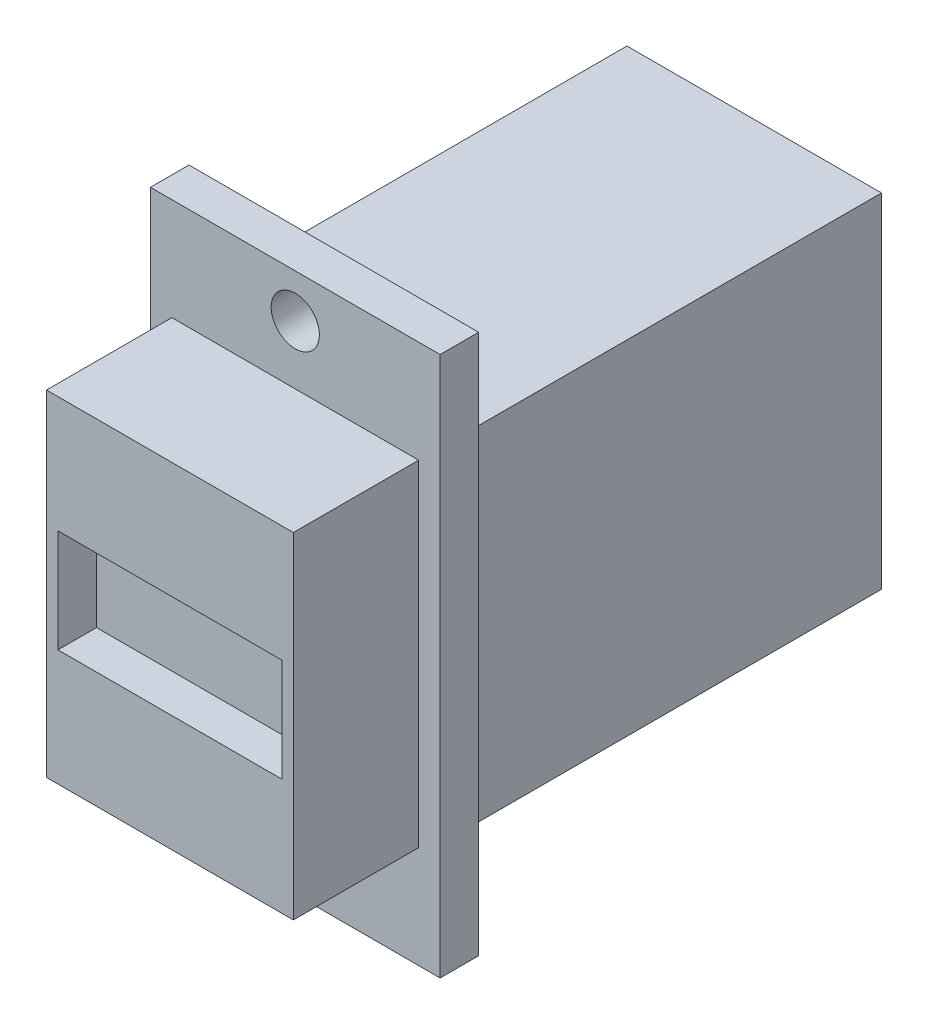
from build123d import *

# Parameters (mm, degrees)
SKETCH1_W           = 19.079642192
SKETCH1_H           = 35.56
SKETCH1_R           = 1.5875
BOSS_EXTRUDE2_DEPTH = 2.54
SKETCH2_W           = 16.256
SKETCH2_H           = 22.098
BOSS_EXTRUDE3_DEPTH = 8.255
SKETCH3_W           = 16.764
SKETCH3_H           = 22.606
BOSS_EXTRUDE4_DEPTH = 27.686
SKETCH4_W           = 14.748140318
SKETCH4_H           = 6.787496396
CUT_EXTRUDE1_DEPTH  = 2.54


with BuildPart() as part:
    # Sketch1 → Boss-Extrude2 (new body)
    with BuildSketch(Plane.XY):
        Rectangle(SKETCH1_W, SKETCH1_H)
        with Locations((0, 14.9225)):
            Circle(SKETCH1_R, mode=Mode.SUBTRACT)
        with Locations((0, -14.605)):
            Circle(SKETCH1_R, mode=Mode.SUBTRACT)
    extrude(amount=BOSS_EXTRUDE2_DEPTH)

    # Sketch2 → Boss-Extrude3 (add)
    with BuildSketch(Plane.XY.offset(2.54)):
        Rectangle(SKETCH2_W, SKETCH2_H)
    extrude(amount=BOSS_EXTRUDE3_DEPTH)

    # Sketch3 → Boss-Extrude4 (add)
    with BuildSketch(Plane(origin=(0, 0, 0), x_dir=(-1, 0, 0), z_dir=(0, 0, -1))):
        Rectangle(SKETCH3_W, SKETCH3_H)
    extrude(amount=BOSS_EXTRUDE4_DEPTH)

    # Sketch4 → Cut-Extrude1 (cut)
    with BuildSketch(Plane.XY.offset(10.795)):
        Rectangle(SKETCH4_W, SKETCH4_H)
    extrude(amount=-CUT_EXTRUDE1_DEPTH, mode=Mode.SUBTRACT)


solid = part.part
